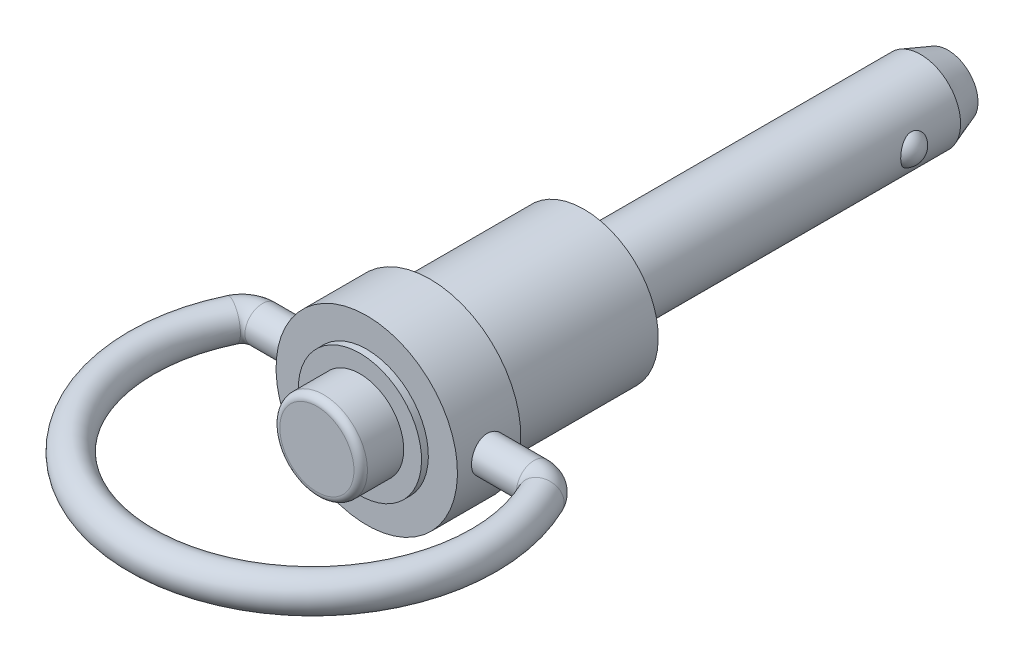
ISO-10303-21;
HEADER;
FILE_DESCRIPTION(('STEP AP214'),'2;1');
FILE_NAME('part.step','',(''),(''),'','','');
FILE_SCHEMA(('AUTOMOTIVE_DESIGN { 1 0 10303 214 1 1 1 1 }'));
ENDSEC;
DATA;
#1=APPLICATION_CONTEXT('core data for automotive mechanical design processes');
#2=APPLICATION_PROTOCOL_DEFINITION('international standard','automotive_design',2000,#1);
#3=PRODUCT_CONTEXT('',#1,'mechanical');
#4=PRODUCT('Part','Part','',(#3));
#5=PRODUCT_RELATED_PRODUCT_CATEGORY('part','',(#4));
#6=PRODUCT_DEFINITION_FORMATION('','',#4);
#7=PRODUCT_DEFINITION_CONTEXT('part definition',#1,'design');
#8=PRODUCT_DEFINITION('design','',#6,#7);
#9=PRODUCT_DEFINITION_SHAPE('','',#8);
#10=(LENGTH_UNIT() NAMED_UNIT(*) SI_UNIT(.MILLI.,.METRE.));
#11=(NAMED_UNIT(*) PLANE_ANGLE_UNIT() SI_UNIT($,.RADIAN.));
#12=(NAMED_UNIT(*) SI_UNIT($,.STERADIAN.) SOLID_ANGLE_UNIT());
#13=UNCERTAINTY_MEASURE_WITH_UNIT(LENGTH_MEASURE(1.E-05),#10,'distance_accuracy_value','');
#14=(GEOMETRIC_REPRESENTATION_CONTEXT(3) GLOBAL_UNCERTAINTY_ASSIGNED_CONTEXT((#13)) GLOBAL_UNIT_ASSIGNED_CONTEXT((#10,
#11,#12)) REPRESENTATION_CONTEXT('',''));
#15=CARTESIAN_POINT('',(0.,0.,0.));
#16=DIRECTION('',(0.,0.,1.));
#17=DIRECTION('',(1.,0.,0.));
#18=AXIS2_PLACEMENT_3D('',#15,#16,#17);
#19=CARTESIAN_POINT('',(0.,0.,20.828));
#20=DIRECTION('',(0.,0.,-1.));
#21=DIRECTION('',(0.,1.,0.));
#22=AXIS2_PLACEMENT_3D('',#19,#20,#21);
#23=CYLINDRICAL_SURFACE('',#22,3.2512);
#24=CARTESIAN_POINT('',(0.,0.,16.637));
#25=DIRECTION('',(0.,0.,-1.));
#26=DIRECTION('',(0.,1.,0.));
#27=AXIS2_PLACEMENT_3D('',#24,#25,#26);
#28=CIRCLE('',#27,3.2512);
#29=CARTESIAN_POINT('',(0.,3.2512,16.637));
#30=VERTEX_POINT('',#29);
#31=EDGE_CURVE('E30',#30,#30,#28,.T.);
#32=ORIENTED_EDGE('',*,*,#31,.F.);
#33=EDGE_LOOP('',(#32));
#34=FACE_BOUND('',#33,.T.);
#35=CARTESIAN_POINT('',(0.,0.,19.328));
#36=DIRECTION('',(0.,0.,1.));
#37=DIRECTION('',(1.,0.,0.));
#38=AXIS2_PLACEMENT_3D('',#35,#36,#37);
#39=CIRCLE('',#38,3.2512);
#40=CARTESIAN_POINT('',(3.2512,0.,19.328));
#41=VERTEX_POINT('',#40);
#42=EDGE_CURVE('E156',#41,#41,#39,.T.);
#43=ORIENTED_EDGE('',*,*,#42,.F.);
#44=EDGE_LOOP('',(#43));
#45=FACE_BOUND('',#44,.T.);
#46=ADVANCED_FACE('F12',(#34,#45),#23,.T.);
#47=CARTESIAN_POINT('',(4.572,0.,16.637));
#48=DIRECTION('',(0.,0.,1.));
#49=DIRECTION('',(0.,-1.,0.));
#50=AXIS2_PLACEMENT_3D('',#47,#48,#49);
#51=PLANE('',#50);
#52=ORIENTED_EDGE('',*,*,#31,.T.);
#53=EDGE_LOOP('',(#52));
#54=FACE_BOUND('',#53,.T.);
#55=CARTESIAN_POINT('',(0.,0.,16.637));
#56=DIRECTION('',(0.,0.,-1.));
#57=DIRECTION('',(0.,1.,0.));
#58=AXIS2_PLACEMENT_3D('',#55,#56,#57);
#59=CIRCLE('',#58,4.572);
#60=CARTESIAN_POINT('',(0.,4.572,16.637));
#61=VERTEX_POINT('',#60);
#62=EDGE_CURVE('E35',#61,#61,#59,.T.);
#63=ORIENTED_EDGE('',*,*,#62,.F.);
#64=EDGE_LOOP('',(#63));
#65=FACE_BOUND('',#64,.T.);
#66=ADVANCED_FACE('F76',(#54,#65),#51,.T.);
#67=CARTESIAN_POINT('',(0.,0.,0.));
#68=DIRECTION('',(0.,0.,-1.));
#69=DIRECTION('',(0.,1.,0.));
#70=AXIS2_PLACEMENT_3D('',#67,#68,#69);
#71=CYLINDRICAL_SURFACE('',#70,4.572);
#72=ORIENTED_EDGE('',*,*,#62,.T.);
#73=EDGE_LOOP('',(#72));
#74=FACE_BOUND('',#73,.T.);
#75=CARTESIAN_POINT('',(0.,0.,16.129));
#76=DIRECTION('',(0.,0.,-1.));
#77=DIRECTION('',(0.,1.,0.));
#78=AXIS2_PLACEMENT_3D('',#75,#76,#77);
#79=CIRCLE('',#78,4.572);
#80=CARTESIAN_POINT('',(0.,4.572,16.129));
#81=VERTEX_POINT('',#80);
#82=EDGE_CURVE('E38',#81,#81,#79,.T.);
#83=ORIENTED_EDGE('',*,*,#82,.F.);
#84=EDGE_LOOP('',(#83));
#85=FACE_BOUND('',#84,.T.);
#86=ADVANCED_FACE('F146',(#74,#85),#71,.T.);
#87=CARTESIAN_POINT('',(6.731,0.,16.129));
#88=DIRECTION('',(0.,0.,1.));
#89=DIRECTION('',(0.,-1.,0.));
#90=AXIS2_PLACEMENT_3D('',#87,#88,#89);
#91=PLANE('',#90);
#92=CARTESIAN_POINT('',(0.,0.,16.129));
#93=DIRECTION('',(0.,0.,-1.));
#94=DIRECTION('',(0.,1.,0.));
#95=AXIS2_PLACEMENT_3D('',#92,#93,#94);
#96=CIRCLE('',#95,6.731);
#97=CARTESIAN_POINT('',(0.,6.731,16.129));
#98=VERTEX_POINT('',#97);
#99=EDGE_CURVE('E41',#98,#98,#96,.T.);
#100=ORIENTED_EDGE('',*,*,#99,.F.);
#101=EDGE_LOOP('',(#100));
#102=FACE_BOUND('',#101,.T.);
#103=ORIENTED_EDGE('',*,*,#82,.T.);
#104=EDGE_LOOP('',(#103));
#105=FACE_BOUND('',#104,.T.);
#106=ADVANCED_FACE('F191',(#102,#105),#91,.T.);
#107=CARTESIAN_POINT('',(0.,0.,0.));
#108=DIRECTION('',(0.,0.,-1.));
#109=DIRECTION('',(0.,1.,0.));
#110=AXIS2_PLACEMENT_3D('',#107,#108,#109);
#111=CYLINDRICAL_SURFACE('',#110,6.731);
#112=ORIENTED_EDGE('',*,*,#99,.T.);
#113=EDGE_LOOP('',(#112));
#114=FACE_BOUND('',#113,.T.);
#115=CARTESIAN_POINT('',(0.,0.,11.43));
#116=DIRECTION('',(0.,0.,-1.));
#117=DIRECTION('',(0.,1.,0.));
#118=AXIS2_PLACEMENT_3D('',#115,#116,#117);
#119=CIRCLE('',#118,6.731);
#120=CARTESIAN_POINT('',(0.,6.731,11.43));
#121=VERTEX_POINT('',#120);
#122=EDGE_CURVE('E27',#121,#121,#119,.T.);
#123=ORIENTED_EDGE('',*,*,#122,.F.);
#124=EDGE_LOOP('',(#123));
#125=FACE_BOUND('',#124,.T.);
#126=CARTESIAN_POINT('',(-6.6051722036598,1.2954,13.7922));
#127=CARTESIAN_POINT('',(-6.60517361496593,1.2953972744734,13.720163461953));
#128=CARTESIAN_POINT('',(-6.60636346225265,1.28937073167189,13.6480919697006));
#129=CARTESIAN_POINT('',(-6.61098794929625,1.26544153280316,13.5059837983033));
#130=CARTESIAN_POINT('',(-6.61442445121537,1.2475290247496,13.4359488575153));
#131=CARTESIAN_POINT('',(-6.62313895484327,1.20040052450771,13.2999904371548));
#132=CARTESIAN_POINT('',(-6.62841519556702,1.17119533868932,13.2340630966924));
#133=CARTESIAN_POINT('',(-6.64021258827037,1.10233951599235,13.1080471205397));
#134=CARTESIAN_POINT('',(-6.64673365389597,1.06268960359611,13.0479580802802));
#135=CARTESIAN_POINT('',(-6.66038139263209,0.973516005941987,12.9345330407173));
#136=CARTESIAN_POINT('',(-6.66751428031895,0.9238817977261,12.8812846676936));
#137=CARTESIAN_POINT('',(-6.68152715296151,0.816387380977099,12.7838165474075));
#138=CARTESIAN_POINT('',(-6.6884071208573,0.758526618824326,12.7395974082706));
#139=CARTESIAN_POINT('',(-6.7012057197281,0.635644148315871,12.6611055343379));
#140=CARTESIAN_POINT('',(-6.70711617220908,0.57056857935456,12.6269156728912));
#141=CARTESIAN_POINT('',(-6.71724013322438,0.435464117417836,12.569987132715));
#142=CARTESIAN_POINT('',(-6.72145378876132,0.365435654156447,12.5472474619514));
#143=CARTESIAN_POINT('',(-6.72766549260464,0.223321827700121,12.5141364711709));
#144=CARTESIAN_POINT('',(-6.72968999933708,0.151272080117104,12.5036173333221));
#145=CARTESIAN_POINT('',(-6.73138656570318,0.00640388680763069,12.494785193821));
#146=CARTESIAN_POINT('',(-6.73105883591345,-0.0664144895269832,12.4964710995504));
#147=CARTESIAN_POINT('',(-6.72810846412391,-0.209738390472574,12.511888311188));
#148=CARTESIAN_POINT('',(-6.72551615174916,-0.280261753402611,12.5254604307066));
#149=CARTESIAN_POINT('',(-6.71836197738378,-0.418011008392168,12.5640127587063));
#150=CARTESIAN_POINT('',(-6.71380004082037,-0.485236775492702,12.5889933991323));
#151=CARTESIAN_POINT('',(-6.70316878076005,-0.614941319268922,12.6498036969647));
#152=CARTESIAN_POINT('',(-6.69709072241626,-0.677389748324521,12.6856964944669));
#153=CARTESIAN_POINT('',(-6.68409856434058,-0.795436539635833,12.7672656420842));
#154=CARTESIAN_POINT('',(-6.677184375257,-0.851034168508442,12.8129430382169));
#155=CARTESIAN_POINT('',(-6.66315320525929,-0.954744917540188,12.9136604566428));
#156=CARTESIAN_POINT('',(-6.65603475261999,-1.00272266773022,12.9688397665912));
#157=CARTESIAN_POINT('',(-6.64250376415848,-1.08876420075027,13.0865320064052));
#158=CARTESIAN_POINT('',(-6.63609123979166,-1.12682782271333,13.1490450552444));
#159=CARTESIAN_POINT('',(-6.62469571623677,-1.19200234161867,13.2798155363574));
#160=CARTESIAN_POINT('',(-6.61971540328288,-1.21909269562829,13.3480834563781));
#161=CARTESIAN_POINT('',(-6.61178862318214,-1.26138008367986,13.4883195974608));
#162=CARTESIAN_POINT('',(-6.60884191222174,-1.27657854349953,13.5602873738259));
#163=CARTESIAN_POINT('',(-6.60536444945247,-1.29445125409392,13.7046572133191));
#164=CARTESIAN_POINT('',(-6.60479610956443,-1.29732037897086,13.7770342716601));
#165=CARTESIAN_POINT('',(-6.60603903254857,-1.29097613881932,13.9212330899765));
#166=CARTESIAN_POINT('',(-6.60785017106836,-1.28176340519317,13.9930548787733));
#167=CARTESIAN_POINT('',(-6.6136128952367,-1.25168453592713,14.1334581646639));
#168=CARTESIAN_POINT('',(-6.61754556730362,-1.23092132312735,14.2020625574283));
#169=CARTESIAN_POINT('',(-6.62709183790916,-1.17844042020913,14.334818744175));
#170=CARTESIAN_POINT('',(-6.63270556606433,-1.14672188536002,14.3989701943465));
#171=CARTESIAN_POINT('',(-6.6450665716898,-1.07278507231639,14.5218557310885));
#172=CARTESIAN_POINT('',(-6.65182676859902,-1.03044414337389,14.5805146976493));
#173=CARTESIAN_POINT('',(-6.66568301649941,-0.936629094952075,14.6899658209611));
#174=CARTESIAN_POINT('',(-6.67277909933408,-0.885154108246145,14.7407572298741));
#175=CARTESIAN_POINT('',(-6.6866288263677,-0.773660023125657,14.8337637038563));
#176=CARTESIAN_POINT('',(-6.69337621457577,-0.713530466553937,14.8758474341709));
#177=CARTESIAN_POINT('',(-6.70566168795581,-0.586941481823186,14.9493152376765));
#178=CARTESIAN_POINT('',(-6.71119982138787,-0.520482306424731,14.9806997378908));
#179=CARTESIAN_POINT('',(-6.72041595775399,-0.383476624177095,15.0316835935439));
#180=CARTESIAN_POINT('',(-6.72410395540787,-0.312954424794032,15.0513463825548));
#181=CARTESIAN_POINT('',(-6.72924701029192,-0.169530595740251,15.0785305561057));
#182=CARTESIAN_POINT('',(-6.7307023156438,-0.0966292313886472,15.0860532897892));
#183=CARTESIAN_POINT('',(-6.73121071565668,0.0482259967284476,15.0886947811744));
#184=CARTESIAN_POINT('',(-6.73030215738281,0.120176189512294,15.0840115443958));
#185=CARTESIAN_POINT('',(-6.72626496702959,0.26224403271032,15.0628090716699));
#186=CARTESIAN_POINT('',(-6.72313635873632,0.332361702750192,15.0462899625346));
#187=CARTESIAN_POINT('',(-6.71501101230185,0.468662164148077,15.0019698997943));
#188=CARTESIAN_POINT('',(-6.710017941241,0.534852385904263,14.9741910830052));
#189=CARTESIAN_POINT('',(-6.69870305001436,0.661661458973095,14.9081643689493));
#190=CARTESIAN_POINT('',(-6.69238113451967,0.722279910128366,14.8699157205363));
#191=CARTESIAN_POINT('',(-6.6789853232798,0.837208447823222,14.7833588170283));
#192=CARTESIAN_POINT('',(-6.67190155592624,0.891410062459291,14.7349080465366));
#193=CARTESIAN_POINT('',(-6.65784127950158,0.990982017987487,14.62961686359));
#194=CARTESIAN_POINT('',(-6.65086479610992,1.03635027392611,14.5727744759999));
#195=CARTESIAN_POINT('',(-6.63773378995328,1.11738877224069,14.4516440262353));
#196=CARTESIAN_POINT('',(-6.63158802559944,1.15295925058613,14.3872882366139));
#197=CARTESIAN_POINT('',(-6.62092027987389,1.21272619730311,14.2534152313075));
#198=CARTESIAN_POINT('',(-6.61639678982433,1.23693323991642,14.1839028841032));
#199=CARTESIAN_POINT('',(-6.61041337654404,1.26845390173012,14.0605363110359));
#200=CARTESIAN_POINT('',(-6.60845980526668,1.27854107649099,14.00739730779));
#201=CARTESIAN_POINT('',(-6.60583870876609,1.29201504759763,13.9002454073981));
#202=CARTESIAN_POINT('',(-6.60517114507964,1.29540204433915,13.8462325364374));
#203=CARTESIAN_POINT('',(-6.6051722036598,1.2954,13.7922));
#204=B_SPLINE_CURVE_WITH_KNOTS('',3,(#126,#127,#128,#129,#130,#131,#132,#133,#134,#135,#136,
#137,#138,#139,#140,#141,#142,#143,#144,#145,#146,#147,#148,#149,#150,#151,#152,#153,#154,#155,
#156,#157,#158,#159,#160,#161,#162,#163,#164,#165,#166,#167,#168,#169,#170,#171,#172,#173,#174,
#175,#176,#177,#178,#179,#180,#181,#182,#183,#184,#185,#186,#187,#188,#189,#190,#191,#192,#193,
#194,#195,#196,#197,#198,#199,#200,#201,#202,#203),.UNSPECIFIED.,.T.,.F.,(4,2,2,2,2,2,2,2,2,2,2,
2,2,2,2,2,2,2,2,2,2,2,2,2,2,2,2,2,2,2,2,2,2,2,2,2,2,2,4),(0.,0.215911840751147,
0.432002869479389,0.647887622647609,0.86375740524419,1.08216318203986,1.30058366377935,
1.52076118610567,1.74091962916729,1.95838638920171,2.1758336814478,2.39041258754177,
2.60499961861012,2.82085272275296,3.0367289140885,3.25609136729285,3.47545737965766,
3.69523218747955,3.91498064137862,4.13124273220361,4.34749352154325,4.56184753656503,
4.77621808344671,4.99318797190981,5.21017847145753,5.43023526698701,5.65028327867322,
5.86912939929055,6.08795119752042,6.30324544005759,6.51853737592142,6.73340808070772,
6.94829420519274,7.16640910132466,7.38457541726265,7.60488731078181,7.82499378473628,
7.98694789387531,8.14889715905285),.UNSPECIFIED.);
#205=CARTESIAN_POINT('',(-6.6051722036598,1.2954,13.7922));
#206=VERTEX_POINT('',#205);
#207=EDGE_CURVE('E88',#206,#206,#204,.T.);
#208=ORIENTED_EDGE('',*,*,#207,.F.);
#209=EDGE_LOOP('',(#208));
#210=FACE_BOUND('',#209,.T.);
#211=CARTESIAN_POINT('',(6.6051722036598,1.2954,13.7922));
#212=CARTESIAN_POINT('',(6.60517361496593,1.2953972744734,13.864236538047));
#213=CARTESIAN_POINT('',(6.60636346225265,1.2893707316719,13.9363080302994));
#214=CARTESIAN_POINT('',(6.61098794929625,1.26544153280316,14.0784162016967));
#215=CARTESIAN_POINT('',(6.61442445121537,1.24752902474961,14.1484511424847));
#216=CARTESIAN_POINT('',(6.62313895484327,1.20040052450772,14.2844095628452));
#217=CARTESIAN_POINT('',(6.62841519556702,1.17119533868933,14.3503369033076));
#218=CARTESIAN_POINT('',(6.64021258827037,1.10233951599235,14.4763528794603));
#219=CARTESIAN_POINT('',(6.64673365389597,1.06268960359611,14.5364419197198));
#220=CARTESIAN_POINT('',(6.66038139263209,0.973516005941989,14.6498669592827));
#221=CARTESIAN_POINT('',(6.66751428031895,0.923881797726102,14.7031153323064));
#222=CARTESIAN_POINT('',(6.68152715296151,0.816387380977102,14.8005834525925));
#223=CARTESIAN_POINT('',(6.6884071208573,0.75852661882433,14.8448025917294));
#224=CARTESIAN_POINT('',(6.7012057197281,0.635644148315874,14.9232944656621));
#225=CARTESIAN_POINT('',(6.70711617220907,0.570568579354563,14.9574843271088));
#226=CARTESIAN_POINT('',(6.71724013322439,0.435464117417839,15.014412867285));
#227=CARTESIAN_POINT('',(6.72145378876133,0.36543565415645,15.0371525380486));
#228=CARTESIAN_POINT('',(6.72766549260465,0.223321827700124,15.0702635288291));
#229=CARTESIAN_POINT('',(6.72968999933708,0.151272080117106,15.0807826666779));
#230=CARTESIAN_POINT('',(6.73138656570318,0.00640388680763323,15.089614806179));
#231=CARTESIAN_POINT('',(6.73105883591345,-0.0664144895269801,15.0879289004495));
#232=CARTESIAN_POINT('',(6.72810846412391,-0.209738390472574,15.072511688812));
#233=CARTESIAN_POINT('',(6.72551615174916,-0.280261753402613,15.0589395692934));
#234=CARTESIAN_POINT('',(6.71836197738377,-0.418011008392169,15.0203872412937));
#235=CARTESIAN_POINT('',(6.71380004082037,-0.485236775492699,14.9954066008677));
#236=CARTESIAN_POINT('',(6.70316878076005,-0.614941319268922,14.9345963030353));
#237=CARTESIAN_POINT('',(6.69709072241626,-0.677389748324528,14.8987035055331));
#238=CARTESIAN_POINT('',(6.68409856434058,-0.79543653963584,14.8171343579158));
#239=CARTESIAN_POINT('',(6.677184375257,-0.851034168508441,14.7714569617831));
#240=CARTESIAN_POINT('',(6.66315320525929,-0.954744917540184,14.6707395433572));
#241=CARTESIAN_POINT('',(6.65603475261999,-1.00272266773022,14.6155602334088));
#242=CARTESIAN_POINT('',(6.64250376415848,-1.08876420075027,14.4978679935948));
#243=CARTESIAN_POINT('',(6.63609123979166,-1.12682782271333,14.4353549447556));
#244=CARTESIAN_POINT('',(6.62469571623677,-1.19200234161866,14.3045844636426));
#245=CARTESIAN_POINT('',(6.61971540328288,-1.21909269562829,14.2363165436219));
#246=CARTESIAN_POINT('',(6.61178862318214,-1.26138008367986,14.0960804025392));
#247=CARTESIAN_POINT('',(6.60884191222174,-1.27657854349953,14.0241126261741));
#248=CARTESIAN_POINT('',(6.60536444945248,-1.29445125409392,13.8797427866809));
#249=CARTESIAN_POINT('',(6.60479610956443,-1.29732037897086,13.8073657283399));
#250=CARTESIAN_POINT('',(6.60603903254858,-1.29097613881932,13.6631669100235));
#251=CARTESIAN_POINT('',(6.60785017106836,-1.28176340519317,13.5913451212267));
#252=CARTESIAN_POINT('',(6.6136128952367,-1.25168453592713,13.4509418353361));
#253=CARTESIAN_POINT('',(6.61754556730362,-1.23092132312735,13.3823374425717));
#254=CARTESIAN_POINT('',(6.62709183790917,-1.17844042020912,13.249581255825));
#255=CARTESIAN_POINT('',(6.63270556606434,-1.14672188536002,13.1854298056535));
#256=CARTESIAN_POINT('',(6.64506657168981,-1.07278507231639,13.0625442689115));
#257=CARTESIAN_POINT('',(6.65182676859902,-1.03044414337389,13.0038853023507));
#258=CARTESIAN_POINT('',(6.66568301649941,-0.936629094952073,12.8944341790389));
#259=CARTESIAN_POINT('',(6.67277909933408,-0.885154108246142,12.8436427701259));
#260=CARTESIAN_POINT('',(6.68662882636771,-0.773660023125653,12.7506362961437));
#261=CARTESIAN_POINT('',(6.69337621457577,-0.713530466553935,12.7085525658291));
#262=CARTESIAN_POINT('',(6.70566168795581,-0.586941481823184,12.6350847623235));
#263=CARTESIAN_POINT('',(6.71119982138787,-0.520482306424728,12.6037002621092));
#264=CARTESIAN_POINT('',(6.72041595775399,-0.383476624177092,12.5527164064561));
#265=CARTESIAN_POINT('',(6.72410395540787,-0.31295442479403,12.5330536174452));
#266=CARTESIAN_POINT('',(6.72924701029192,-0.169530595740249,12.5058694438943));
#267=CARTESIAN_POINT('',(6.7307023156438,-0.0966292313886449,12.4983467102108));
#268=CARTESIAN_POINT('',(6.73121071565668,0.0482259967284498,12.4957052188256));
#269=CARTESIAN_POINT('',(6.73030215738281,0.120176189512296,12.5003884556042));
#270=CARTESIAN_POINT('',(6.72626496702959,0.262244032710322,12.5215909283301));
#271=CARTESIAN_POINT('',(6.72313635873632,0.332361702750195,12.5381100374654));
#272=CARTESIAN_POINT('',(6.71501101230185,0.46866216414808,12.5824301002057));
#273=CARTESIAN_POINT('',(6.710017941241,0.534852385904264,12.6102089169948));
#274=CARTESIAN_POINT('',(6.69870305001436,0.661661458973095,12.6762356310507));
#275=CARTESIAN_POINT('',(6.69238113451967,0.722279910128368,12.7144842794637));
#276=CARTESIAN_POINT('',(6.6789853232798,0.837208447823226,12.8010411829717));
#277=CARTESIAN_POINT('',(6.67190155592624,0.891410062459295,12.8494919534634));
#278=CARTESIAN_POINT('',(6.65784127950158,0.99098201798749,12.95478313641));
#279=CARTESIAN_POINT('',(6.65086479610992,1.03635027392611,13.0116255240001));
#280=CARTESIAN_POINT('',(6.63773378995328,1.1173887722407,13.1327559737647));
#281=CARTESIAN_POINT('',(6.63158802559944,1.15295925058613,13.1971117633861));
#282=CARTESIAN_POINT('',(6.62092027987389,1.21272619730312,13.3309847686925));
#283=CARTESIAN_POINT('',(6.61639678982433,1.23693323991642,13.4004971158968));
#284=CARTESIAN_POINT('',(6.61041337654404,1.26845390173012,13.5238636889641));
#285=CARTESIAN_POINT('',(6.60845980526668,1.27854107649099,13.57700269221));
#286=CARTESIAN_POINT('',(6.60583870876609,1.29201504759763,13.6841545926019));
#287=CARTESIAN_POINT('',(6.60517114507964,1.29540204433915,13.7381674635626));
#288=CARTESIAN_POINT('',(6.6051722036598,1.2954,13.7922));
#289=B_SPLINE_CURVE_WITH_KNOTS('',3,(#211,#212,#213,#214,#215,#216,#217,#218,#219,#220,#221,
#222,#223,#224,#225,#226,#227,#228,#229,#230,#231,#232,#233,#234,#235,#236,#237,#238,#239,#240,
#241,#242,#243,#244,#245,#246,#247,#248,#249,#250,#251,#252,#253,#254,#255,#256,#257,#258,#259,
#260,#261,#262,#263,#264,#265,#266,#267,#268,#269,#270,#271,#272,#273,#274,#275,#276,#277,#278,
#279,#280,#281,#282,#283,#284,#285,#286,#287,#288),.UNSPECIFIED.,.T.,.F.,(4,2,2,2,2,2,2,2,2,2,2,
2,2,2,2,2,2,2,2,2,2,2,2,2,2,2,2,2,2,2,2,2,2,2,2,2,2,2,4),(0.,0.215911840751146,
0.432002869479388,0.647887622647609,0.86375740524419,1.08216318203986,1.30058366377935,
1.52076118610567,1.74091962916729,1.95838638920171,2.1758336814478,2.39041258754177,
2.60499961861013,2.82085272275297,3.0367289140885,3.25609136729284,3.47545737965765,
3.69523218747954,3.91498064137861,4.13124273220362,4.34749352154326,4.56184753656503,
4.7762180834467,4.99318797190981,5.21017847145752,5.430235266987,5.65028327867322,
5.86912939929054,6.08795119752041,6.30324544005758,6.51853737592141,6.73340808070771,
6.94829420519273,7.16640910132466,7.38457541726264,7.60488731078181,7.82499378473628,
7.9869478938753,8.14889715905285),.UNSPECIFIED.);
#290=CARTESIAN_POINT('',(6.6051722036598,1.2954,13.7922));
#291=VERTEX_POINT('',#290);
#292=EDGE_CURVE('E79',#291,#291,#289,.T.);
#293=ORIENTED_EDGE('',*,*,#292,.F.);
#294=EDGE_LOOP('',(#293));
#295=FACE_BOUND('',#294,.T.);
#296=ADVANCED_FACE('F142',(#114,#125,#210,#295),#111,.T.);
#297=CARTESIAN_POINT('',(5.7785,0.,11.43));
#298=DIRECTION('',(0.,0.,-1.));
#299=DIRECTION('',(0.,1.,0.));
#300=AXIS2_PLACEMENT_3D('',#297,#298,#299);
#301=PLANE('',#300);
#302=CARTESIAN_POINT('',(0.,0.,11.43));
#303=DIRECTION('',(0.,0.,-1.));
#304=DIRECTION('',(0.,1.,0.));
#305=AXIS2_PLACEMENT_3D('',#302,#303,#304);
#306=CIRCLE('',#305,5.9);
#307=CARTESIAN_POINT('',(0.,5.9,11.43));
#308=VERTEX_POINT('',#307);
#309=EDGE_CURVE('E19',#308,#308,#306,.F.);
#310=ORIENTED_EDGE('',*,*,#309,.T.);
#311=EDGE_LOOP('',(#310));
#312=FACE_BOUND('',#311,.T.);
#313=ORIENTED_EDGE('',*,*,#122,.T.);
#314=EDGE_LOOP('',(#313));
#315=FACE_BOUND('',#314,.T.);
#316=ADVANCED_FACE('F136',(#312,#315),#301,.T.);
#317=CARTESIAN_POINT('',(10.0803124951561,0.,15.3162));
#318=DIRECTION('',(0.,1.,0.));
#319=DIRECTION('',(-1.,0.,0.));
#320=AXIS2_PLACEMENT_3D('',#317,#318,#319);
#321=TOROIDAL_SURFACE('',#320,1.524,1.2954);
#322=CARTESIAN_POINT('',(11.4549005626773,0.,14.658109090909));
#323=DIRECTION('',(-0.431818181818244,0.,-0.901960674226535));
#324=DIRECTION('',(0.901960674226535,0.,-0.431818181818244));
#325=AXIS2_PLACEMENT_3D('',#322,#323,#324);
#326=CIRCLE('',#325,1.2954);
#327=CARTESIAN_POINT('',(12.6233004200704,0.,14.0987318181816));
#328=VERTEX_POINT('',#327);
#329=EDGE_CURVE('E46',#328,#328,#326,.T.);
#330=ORIENTED_EDGE('',*,*,#329,.T.);
#331=EDGE_LOOP('',(#330));
#332=FACE_BOUND('',#331,.T.);
#333=CARTESIAN_POINT('',(10.0803124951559,0.,13.7922));
#334=DIRECTION('',(1.,0.,0.));
#335=DIRECTION('',(0.,1.,0.));
#336=AXIS2_PLACEMENT_3D('',#333,#334,#335);
#337=CIRCLE('',#336,1.2954);
#338=CARTESIAN_POINT('',(10.0803124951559,1.2954,13.7922));
#339=VERTEX_POINT('',#338);
#340=EDGE_CURVE('E34',#339,#339,#337,.F.);
#341=ORIENTED_EDGE('',*,*,#340,.F.);
#342=EDGE_LOOP('',(#341));
#343=FACE_BOUND('',#342,.T.);
#344=ADVANCED_FACE('F74',(#332,#343),#321,.T.);
#345=CARTESIAN_POINT('',(-10.0803124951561,0.,13.7922));
#346=DIRECTION('',(1.,0.,0.));
#347=DIRECTION('',(0.,1.,0.));
#348=AXIS2_PLACEMENT_3D('',#345,#346,#347);
#349=CYLINDRICAL_SURFACE('',#348,1.2954);
#350=ORIENTED_EDGE('',*,*,#340,.T.);
#351=EDGE_LOOP('',(#350));
#352=FACE_BOUND('',#351,.T.);
#353=ORIENTED_EDGE('',*,*,#292,.T.);
#354=EDGE_LOOP('',(#353));
#355=FACE_BOUND('',#354,.T.);
#356=ADVANCED_FACE('F70',(#352,#355),#349,.T.);
#357=CARTESIAN_POINT('',(0.,0.,20.1422));
#358=DIRECTION('',(0.,1.,0.));
#359=DIRECTION('',(-1.,0.,0.));
#360=AXIS2_PLACEMENT_3D('',#357,#358,#359);
#361=TOROIDAL_SURFACE('',#360,12.7,1.2954);
#362=CARTESIAN_POINT('',(-11.4549005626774,0.,14.6581090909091));
#363=DIRECTION('',(-0.43181818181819,0.,0.901960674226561));
#364=DIRECTION('',(-0.901960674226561,0.,-0.43181818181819));
#365=AXIS2_PLACEMENT_3D('',#362,#363,#364);
#366=CIRCLE('',#365,1.2954);
#367=CARTESIAN_POINT('',(-12.6233004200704,0.,14.0987318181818));
#368=VERTEX_POINT('',#367);
#369=EDGE_CURVE('E49',#368,#368,#366,.F.);
#370=ORIENTED_EDGE('',*,*,#369,.F.);
#371=EDGE_LOOP('',(#370));
#372=FACE_BOUND('',#371,.T.);
#373=ORIENTED_EDGE('',*,*,#329,.F.);
#374=EDGE_LOOP('',(#373));
#375=FACE_BOUND('',#374,.T.);
#376=ADVANCED_FACE('F67',(#372,#375),#361,.T.);
#377=CARTESIAN_POINT('',(-10.0803124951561,0.,15.3162));
#378=DIRECTION('',(0.,1.,0.));
#379=DIRECTION('',(-1.,0.,0.));
#380=AXIS2_PLACEMENT_3D('',#377,#378,#379);
#381=TOROIDAL_SURFACE('',#380,1.524,1.2954);
#382=CARTESIAN_POINT('',(-10.0803124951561,0.,13.7922));
#383=DIRECTION('',(1.,0.,0.));
#384=DIRECTION('',(0.,1.,0.));
#385=AXIS2_PLACEMENT_3D('',#382,#383,#384);
#386=CIRCLE('',#385,1.2954);
#387=CARTESIAN_POINT('',(-10.0803124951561,1.2954,13.7922));
#388=VERTEX_POINT('',#387);
#389=EDGE_CURVE('E33',#388,#388,#386,.T.);
#390=ORIENTED_EDGE('',*,*,#389,.F.);
#391=EDGE_LOOP('',(#390));
#392=FACE_BOUND('',#391,.T.);
#393=ORIENTED_EDGE('',*,*,#369,.T.);
#394=EDGE_LOOP('',(#393));
#395=FACE_BOUND('',#394,.T.);
#396=ADVANCED_FACE('F62',(#392,#395),#381,.T.);
#397=CARTESIAN_POINT('',(-10.0803124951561,0.,13.7922));
#398=DIRECTION('',(1.,0.,0.));
#399=DIRECTION('',(0.,1.,0.));
#400=AXIS2_PLACEMENT_3D('',#397,#398,#399);
#401=CYLINDRICAL_SURFACE('',#400,1.2954);
#402=ORIENTED_EDGE('',*,*,#389,.T.);
#403=EDGE_LOOP('',(#402));
#404=FACE_BOUND('',#403,.T.);
#405=ORIENTED_EDGE('',*,*,#207,.T.);
#406=EDGE_LOOP('',(#405));
#407=FACE_BOUND('',#406,.T.);
#408=ADVANCED_FACE('F66',(#404,#407),#401,.T.);
#409=CARTESIAN_POINT('',(0.,0.,19.828));
#410=DIRECTION('',(0.,0.,1.));
#411=DIRECTION('',(1.,0.,0.));
#412=AXIS2_PLACEMENT_3D('',#409,#410,#411);
#413=PLANE('',#412);
#414=CARTESIAN_POINT('',(0.,0.,19.828));
#415=DIRECTION('',(0.,0.,1.));
#416=DIRECTION('',(1.,0.,0.));
#417=AXIS2_PLACEMENT_3D('',#414,#415,#416);
#418=CIRCLE('',#417,2.7512);
#419=CARTESIAN_POINT('',(2.7512,0.,19.828));
#420=VERTEX_POINT('',#419);
#421=EDGE_CURVE('E158',#420,#420,#418,.T.);
#422=ORIENTED_EDGE('',*,*,#421,.T.);
#423=EDGE_LOOP('',(#422));
#424=FACE_BOUND('',#423,.T.);
#425=ADVANCED_FACE('F98',(#424),#413,.T.);
#426=CARTESIAN_POINT('',(0.,0.,19.328));
#427=DIRECTION('',(0.,0.,1.));
#428=DIRECTION('',(1.,0.,0.));
#429=AXIS2_PLACEMENT_3D('',#426,#427,#428);
#430=TOROIDAL_SURFACE('',#429,2.7512,0.5);
#431=ORIENTED_EDGE('',*,*,#42,.T.);
#432=EDGE_LOOP('',(#431));
#433=FACE_BOUND('',#432,.T.);
#434=ORIENTED_EDGE('',*,*,#421,.F.);
#435=EDGE_LOOP('',(#434));
#436=FACE_BOUND('',#435,.T.);
#437=ADVANCED_FACE('F169',(#433,#436),#430,.T.);
#438=CARTESIAN_POINT('',(0.,0.,44.4537819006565));
#439=DIRECTION('',(0.,0.,-1.));
#440=DIRECTION('',(0.,1.,0.));
#441=AXIS2_PLACEMENT_3D('',#438,#439,#440);
#442=CYLINDRICAL_SURFACE('',#441,5.5);
#443=CARTESIAN_POINT('',(0.,0.,11.03));
#444=DIRECTION('',(0.,0.,-1.));
#445=DIRECTION('',(0.,1.,0.));
#446=AXIS2_PLACEMENT_3D('',#443,#444,#445);
#447=CIRCLE('',#446,5.5);
#448=CARTESIAN_POINT('',(0.,5.5,11.03));
#449=VERTEX_POINT('',#448);
#450=EDGE_CURVE('E8',#449,#449,#447,.T.);
#451=ORIENTED_EDGE('',*,*,#450,.T.);
#452=EDGE_LOOP('',(#451));
#453=FACE_BOUND('',#452,.T.);
#454=CARTESIAN_POINT('',(0.,0.,0.));
#455=DIRECTION('',(0.,0.,-1.));
#456=DIRECTION('',(0.,1.,0.));
#457=AXIS2_PLACEMENT_3D('',#454,#455,#456);
#458=CIRCLE('',#457,5.5);
#459=CARTESIAN_POINT('',(0.,5.5,0.));
#460=VERTEX_POINT('',#459);
#461=EDGE_CURVE('E159',#460,#460,#458,.T.);
#462=ORIENTED_EDGE('',*,*,#461,.F.);
#463=EDGE_LOOP('',(#462));
#464=FACE_BOUND('',#463,.T.);
#465=ADVANCED_FACE('F105',(#453,#464),#442,.T.);
#466=CARTESIAN_POINT('',(2.23030748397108,0.,-26.9964));
#467=DIRECTION('',(0.,0.,1.));
#468=DIRECTION('',(0.,-1.,0.));
#469=AXIS2_PLACEMENT_3D('',#466,#467,#468);
#470=PLANE('',#469);
#471=CARTESIAN_POINT('',(0.,0.,-26.9963999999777));
#472=DIRECTION('',(0.,0.,1.));
#473=DIRECTION('',(0.,-1.,0.));
#474=AXIS2_PLACEMENT_3D('',#471,#472,#473);
#475=CIRCLE('',#474,2.23030748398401);
#476=CARTESIAN_POINT('',(0.,-2.23030748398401,-26.9963999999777));
#477=VERTEX_POINT('',#476);
#478=EDGE_CURVE('E87',#477,#477,#475,.T.);
#479=ORIENTED_EDGE('',*,*,#478,.F.);
#480=EDGE_LOOP('',(#479));
#481=FACE_BOUND('',#480,.T.);
#482=ADVANCED_FACE('F100',(#481),#470,.F.);
#483=CARTESIAN_POINT('',(2.304415,0.,-21.51));
#484=DIRECTION('',(0.,0.,1.));
#485=DIRECTION('',(1.,0.,0.));
#486=AXIS2_PLACEMENT_3D('',#483,#484,#485);
#487=SPHERICAL_SURFACE('',#486,1.190625);
#488=CARTESIAN_POINT('',(2.969895,0.,-20.5227187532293));
#489=CARTESIAN_POINT('',(2.96989215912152,0.064879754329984,-20.5227204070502));
#490=CARTESIAN_POINT('',(2.9677488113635,0.129813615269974,-20.5276893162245));
#491=CARTESIAN_POINT('',(2.95937088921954,0.257945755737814,-20.547546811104));
#492=CARTESIAN_POINT('',(2.95313050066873,0.321141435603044,-20.5624494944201));
#493=CARTESIAN_POINT('',(2.93717671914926,0.443963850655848,-20.6020770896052));
#494=CARTESIAN_POINT('',(2.927461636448,0.503588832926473,-20.6268067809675));
#495=CARTESIAN_POINT('',(2.90558938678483,0.617402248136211,-20.6858521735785));
#496=CARTESIAN_POINT('',(2.89343280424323,0.671591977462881,-20.7201655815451));
#497=CARTESIAN_POINT('',(2.86839420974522,0.771479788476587,-20.79700516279));
#498=CARTESIAN_POINT('',(2.85553685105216,0.817351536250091,-20.8393126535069));
#499=CARTESIAN_POINT('',(2.83044802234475,0.900403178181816,-20.9319248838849));
#500=CARTESIAN_POINT('',(2.81821622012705,0.937587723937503,-20.9822253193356));
#501=CARTESIAN_POINT('',(2.79710280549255,0.998724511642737,-21.084854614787));
#502=CARTESIAN_POINT('',(2.78802161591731,1.02355036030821,-21.1366201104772));
#503=CARTESIAN_POINT('',(2.77310306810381,1.06331271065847,-21.2442484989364));
#504=CARTESIAN_POINT('',(2.76726231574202,1.07825956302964,-21.3001070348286));
#505=CARTESIAN_POINT('',(2.76014564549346,1.09633656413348,-21.4072555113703));
#506=CARTESIAN_POINT('',(2.75841717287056,1.10064055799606,-21.4583195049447));
#507=CARTESIAN_POINT('',(2.75839177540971,1.10070545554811,-21.5604466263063));
#508=CARTESIAN_POINT('',(2.76009369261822,1.09646924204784,-21.6115097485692));
#509=CARTESIAN_POINT('',(2.76652257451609,1.08013788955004,-21.7091717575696));
#510=CARTESIAN_POINT('',(2.77107366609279,1.0684990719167,-21.7558600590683));
#511=CARTESIAN_POINT('',(2.78254175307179,1.038266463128,-21.8466097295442));
#512=CARTESIAN_POINT('',(2.78945904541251,1.01967179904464,-21.8906707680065));
#513=CARTESIAN_POINT('',(2.80531085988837,0.975235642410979,-21.9770453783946));
#514=CARTESIAN_POINT('',(2.81431949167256,0.949116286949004,-22.0192017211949));
#515=CARTESIAN_POINT('',(2.83329926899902,0.890858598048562,-22.0988701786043));
#516=CARTESIAN_POINT('',(2.84327072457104,0.858718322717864,-22.1363807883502));
#517=CARTESIAN_POINT('',(2.86435381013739,0.785708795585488,-22.2098499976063));
#518=CARTESIAN_POINT('',(2.87547704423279,0.744281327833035,-22.2452503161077));
#519=CARTESIAN_POINT('',(2.89682125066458,0.656317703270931,-22.3093556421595));
#520=CARTESIAN_POINT('',(2.90704166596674,0.609778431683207,-22.3380565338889));
#521=CARTESIAN_POINT('',(2.92666236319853,0.507820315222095,-22.391048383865));
#522=CARTESIAN_POINT('',(2.93587462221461,0.451979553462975,-22.4145978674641));
#523=CARTESIAN_POINT('',(2.95127580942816,0.33704836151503,-22.4530177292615));
#524=CARTESIAN_POINT('',(2.95746769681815,0.277961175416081,-22.4678966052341));
#525=CARTESIAN_POINT('',(2.96452684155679,0.182100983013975,-22.4846891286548));
#526=CARTESIAN_POINT('',(2.96653354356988,0.145876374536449,-22.4894090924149));
#527=CARTESIAN_POINT('',(2.96921843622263,0.0731069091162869,-22.4957056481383));
#528=CARTESIAN_POINT('',(2.9698966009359,0.0365620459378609,-22.4972821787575));
#529=CARTESIAN_POINT('',(2.96989215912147,-0.0648797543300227,-22.4972795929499));
#530=CARTESIAN_POINT('',(2.96774881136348,-0.129813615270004,-22.4923106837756));
#531=CARTESIAN_POINT('',(2.95937088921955,-0.25794575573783,-22.472453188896));
#532=CARTESIAN_POINT('',(2.95313050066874,-0.321141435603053,-22.4575505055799));
#533=CARTESIAN_POINT('',(2.93717671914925,-0.443963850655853,-22.4179229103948));
#534=CARTESIAN_POINT('',(2.927461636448,-0.50358883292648,-22.3931932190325));
#535=CARTESIAN_POINT('',(2.90558938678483,-0.617402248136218,-22.3341478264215));
#536=CARTESIAN_POINT('',(2.89343280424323,-0.671591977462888,-22.2998344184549));
#537=CARTESIAN_POINT('',(2.86839420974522,-0.771479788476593,-22.22299483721));
#538=CARTESIAN_POINT('',(2.85553685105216,-0.817351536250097,-22.1806873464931));
#539=CARTESIAN_POINT('',(2.83044802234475,-0.900403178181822,-22.0880751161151));
#540=CARTESIAN_POINT('',(2.81821622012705,-0.937587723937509,-22.0377746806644));
#541=CARTESIAN_POINT('',(2.79710280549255,-0.998724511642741,-21.935145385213));
#542=CARTESIAN_POINT('',(2.78802161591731,-1.02355036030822,-21.8833798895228));
#543=CARTESIAN_POINT('',(2.77310306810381,-1.06331271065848,-21.7757515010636));
#544=CARTESIAN_POINT('',(2.76726231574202,-1.07825956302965,-21.7198929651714));
#545=CARTESIAN_POINT('',(2.76014564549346,-1.09633656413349,-21.6127444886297));
#546=CARTESIAN_POINT('',(2.75841717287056,-1.10064055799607,-21.5616804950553));
#547=CARTESIAN_POINT('',(2.75839177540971,-1.10070545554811,-21.4595533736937));
#548=CARTESIAN_POINT('',(2.76009369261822,-1.09646924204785,-21.4084902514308));
#549=CARTESIAN_POINT('',(2.76652257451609,-1.08013788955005,-21.3108282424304));
#550=CARTESIAN_POINT('',(2.77107366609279,-1.0684990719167,-21.2641399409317));
#551=CARTESIAN_POINT('',(2.78254175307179,-1.038266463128,-21.1733902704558));
#552=CARTESIAN_POINT('',(2.78945904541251,-1.01967179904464,-21.1293292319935));
#553=CARTESIAN_POINT('',(2.80531085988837,-0.975235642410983,-21.0429546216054));
#554=CARTESIAN_POINT('',(2.81431949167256,-0.949116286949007,-21.0007982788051));
#555=CARTESIAN_POINT('',(2.83329926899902,-0.890858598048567,-20.9211298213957));
#556=CARTESIAN_POINT('',(2.84327072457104,-0.85871832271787,-20.8836192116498));
#557=CARTESIAN_POINT('',(2.86435381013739,-0.785708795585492,-20.8101500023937));
#558=CARTESIAN_POINT('',(2.87547704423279,-0.744281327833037,-20.7747496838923));
#559=CARTESIAN_POINT('',(2.89682125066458,-0.656317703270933,-20.7106443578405));
#560=CARTESIAN_POINT('',(2.90704166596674,-0.609778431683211,-20.6819434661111));
#561=CARTESIAN_POINT('',(2.92666236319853,-0.5078203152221,-20.628951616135));
#562=CARTESIAN_POINT('',(2.93587462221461,-0.451979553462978,-20.6054021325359));
#563=CARTESIAN_POINT('',(2.95127580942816,-0.337048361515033,-20.5669822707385));
#564=CARTESIAN_POINT('',(2.95746769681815,-0.277961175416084,-20.5521033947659));
#565=CARTESIAN_POINT('',(2.96452684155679,-0.182100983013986,-20.5353108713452));
#566=CARTESIAN_POINT('',(2.96653354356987,-0.145876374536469,-20.5305909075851));
#567=CARTESIAN_POINT('',(2.96921843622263,-0.0731069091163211,-20.5242943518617));
#568=CARTESIAN_POINT('',(2.96989660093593,-0.0365620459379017,-20.5227178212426));
#569=CARTESIAN_POINT('',(2.969895,0.,-20.5227187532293));
#570=B_SPLINE_CURVE_WITH_KNOTS('',3,(#488,#489,#490,#491,#492,#493,#494,#495,#496,#497,#498,
#499,#500,#501,#502,#503,#504,#505,#506,#507,#508,#509,#510,#511,#512,#513,#514,#515,#516,#517,
#518,#519,#520,#521,#522,#523,#524,#525,#526,#527,#528,#529,#530,#531,#532,#533,#534,#535,#536,
#537,#538,#539,#540,#541,#542,#543,#544,#545,#546,#547,#548,#549,#550,#551,#552,#553,#554,#555,
#556,#557,#558,#559,#560,#561,#562,#563,#564,#565,#566,#567,#568,#569),.UNSPECIFIED.,.T.,.F.,(4,
2,2,2,2,2,2,2,2,2,2,2,2,2,2,2,2,2,2,2,2,2,2,2,2,2,2,2,2,2,2,2,2,2,2,2,2,2,2,2,4),(0.,
0.194508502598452,0.389293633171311,0.584173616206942,0.779007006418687,0.969128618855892,
1.15914819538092,1.33252765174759,1.50572516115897,1.65874388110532,1.81171095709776,
1.95605797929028,2.10042312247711,2.25101209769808,2.4016497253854,2.56781072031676,
2.73407352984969,2.91718248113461,3.10011167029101,3.20972198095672,3.31933443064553,
3.51384293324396,3.7086280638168,3.90350804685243,4.09834143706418,4.28846304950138,
4.47848262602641,4.65186208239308,4.82505959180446,4.97807831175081,5.13104538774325,
5.27539240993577,5.4197575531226,5.57034652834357,5.72098415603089,5.88714515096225,
6.05340796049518,6.2365169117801,6.4194461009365,6.52905641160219,6.63866886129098),.UNSPECIFIED.);
#571=CARTESIAN_POINT('',(2.969895,0.,-20.5227187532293));
#572=VERTEX_POINT('',#571);
#573=EDGE_CURVE('E115',#572,#572,#570,.T.);
#574=ORIENTED_EDGE('',*,*,#573,.F.);
#575=EDGE_LOOP('',(#574));
#576=FACE_BOUND('',#575,.T.);
#577=ADVANCED_FACE('F104',(#576),#487,.T.);
#578=CARTESIAN_POINT('',(-2.304335,0.,-21.51));
#579=DIRECTION('',(0.,0.,1.));
#580=DIRECTION('',(1.,0.,0.));
#581=AXIS2_PLACEMENT_3D('',#578,#579,#580);
#582=SPHERICAL_SURFACE('',#581,1.190625);
#583=CARTESIAN_POINT('',(-2.969895,0.,-20.5227726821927));
#584=CARTESIAN_POINT('',(-2.96989215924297,-0.0648782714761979,-20.5227743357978));
#585=CARTESIAN_POINT('',(-2.96774890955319,-0.129810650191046,-20.5277431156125));
#586=CARTESIAN_POINT('',(-2.95937136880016,-0.257939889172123,-20.5476001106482));
#587=CARTESIAN_POINT('',(-2.95313126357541,-0.321134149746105,-20.5625024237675));
#588=CARTESIAN_POINT('',(-2.9371782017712,-0.44395384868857,-20.602129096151));
#589=CARTESIAN_POINT('',(-2.92746355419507,-0.503577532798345,-20.6268582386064));
#590=CARTESIAN_POINT('',(-2.90559229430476,-0.617388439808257,-20.6859024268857));
#591=CARTESIAN_POINT('',(-2.89343626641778,-0.67157695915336,-20.720215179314));
#592=CARTESIAN_POINT('',(-2.86839896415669,-0.77146199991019,-20.7970531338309));
#593=CARTESIAN_POINT('',(-2.85554234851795,-0.817332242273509,-20.8393595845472));
#594=CARTESIAN_POINT('',(-2.83045508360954,-0.900380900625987,-20.9319696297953));
#595=CARTESIAN_POINT('',(-2.8182241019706,-0.937563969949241,-20.9822689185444));
#596=CARTESIAN_POINT('',(-2.79711253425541,-0.998697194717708,-21.0848948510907));
#597=CARTESIAN_POINT('',(-2.78803232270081,-1.02352115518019,-21.1366580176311));
#598=CARTESIAN_POINT('',(-2.77311559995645,-1.06327998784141,-21.2442814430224));
#599=CARTESIAN_POINT('',(-2.76727569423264,-1.07822521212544,-21.3001373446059));
#600=CARTESIAN_POINT('',(-2.76016046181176,-1.09629924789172,-21.4072797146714));
#601=CARTESIAN_POINT('',(-2.75843254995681,-1.10060201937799,-21.4583402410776));
#602=CARTESIAN_POINT('',(-2.75840791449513,-1.10066500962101,-21.5604602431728));
#603=CARTESIAN_POINT('',(-2.76011003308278,-1.09642811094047,-21.6115197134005));
#604=CARTESIAN_POINT('',(-2.7665389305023,-1.08009599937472,-21.7091745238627));
#605=CARTESIAN_POINT('',(-2.77108985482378,-1.06845708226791,-21.7558592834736));
#606=CARTESIAN_POINT('',(-2.78255728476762,-1.03822483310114,-21.8466019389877));
#607=CARTESIAN_POINT('',(-2.78947408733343,-1.01963062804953,-21.8906595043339));
#608=CARTESIAN_POINT('',(-2.80532470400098,-0.97519579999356,-21.9770275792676));
#609=CARTESIAN_POINT('',(-2.81433263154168,-0.949077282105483,-22.0191808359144));
#610=CARTESIAN_POINT('',(-2.83331083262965,-0.890821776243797,-22.098843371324));
#611=CARTESIAN_POINT('',(-2.84328141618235,-0.858682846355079,-22.1363511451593));
#612=CARTESIAN_POINT('',(-2.86436272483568,-0.785676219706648,-22.2098152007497));
#613=CARTESIAN_POINT('',(-2.87548504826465,-0.744250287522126,-22.2452131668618));
#614=CARTESIAN_POINT('',(-2.89682746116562,-0.656290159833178,-22.3093141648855));
#615=CARTESIAN_POINT('',(-2.907046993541,-0.609752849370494,-22.338013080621));
#616=CARTESIAN_POINT('',(-2.92666611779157,-0.507798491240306,-22.3910016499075));
#617=CARTESIAN_POINT('',(-2.93587767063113,-0.451959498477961,-22.4145497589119));
#618=CARTESIAN_POINT('',(-2.95127762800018,-0.337032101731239,-22.4529672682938));
#619=CARTESIAN_POINT('',(-2.95746899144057,-0.277946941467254,-22.467845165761));
#620=CARTESIAN_POINT('',(-2.96452744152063,-0.182090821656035,-22.4846363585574));
#621=CARTESIAN_POINT('',(-2.96653391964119,-0.14586821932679,-22.4893558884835));
#622=CARTESIAN_POINT('',(-2.96921851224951,-0.0731028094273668,-22.4956518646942));
#623=CARTESIAN_POINT('',(-2.96989660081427,-0.0365599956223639,-22.4972282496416));
#624=CARTESIAN_POINT('',(-2.96989215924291,0.0648782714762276,-22.4972256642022));
#625=CARTESIAN_POINT('',(-2.96774890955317,0.129810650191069,-22.4922568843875));
#626=CARTESIAN_POINT('',(-2.95937136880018,0.257939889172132,-22.4723998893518));
#627=CARTESIAN_POINT('',(-2.95313126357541,0.321134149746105,-22.4574975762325));
#628=CARTESIAN_POINT('',(-2.9371782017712,0.443953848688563,-22.417870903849));
#629=CARTESIAN_POINT('',(-2.92746355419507,0.503577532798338,-22.3931417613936));
#630=CARTESIAN_POINT('',(-2.90559229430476,0.617388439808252,-22.3340975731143));
#631=CARTESIAN_POINT('',(-2.89343626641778,0.671576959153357,-22.299784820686));
#632=CARTESIAN_POINT('',(-2.86839896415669,0.771461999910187,-22.2229468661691));
#633=CARTESIAN_POINT('',(-2.85554234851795,0.817332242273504,-22.1806404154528));
#634=CARTESIAN_POINT('',(-2.83045508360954,0.900380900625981,-22.0880303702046));
#635=CARTESIAN_POINT('',(-2.8182241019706,0.937563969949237,-22.0377310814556));
#636=CARTESIAN_POINT('',(-2.79711253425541,0.998697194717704,-21.9351051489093));
#637=CARTESIAN_POINT('',(-2.78803232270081,1.02352115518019,-21.8833419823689));
#638=CARTESIAN_POINT('',(-2.77311559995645,1.0632799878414,-21.7757185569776));
#639=CARTESIAN_POINT('',(-2.76727569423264,1.07822521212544,-21.7198626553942));
#640=CARTESIAN_POINT('',(-2.76016046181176,1.09629924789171,-21.6127202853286));
#641=CARTESIAN_POINT('',(-2.75843254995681,1.10060201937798,-21.5616597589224));
#642=CARTESIAN_POINT('',(-2.75840791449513,1.10066500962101,-21.4595397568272));
#643=CARTESIAN_POINT('',(-2.76011003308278,1.09642811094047,-21.4084802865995));
#644=CARTESIAN_POINT('',(-2.7665389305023,1.08009599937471,-21.3108254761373));
#645=CARTESIAN_POINT('',(-2.77108985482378,1.0684570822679,-21.2641407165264));
#646=CARTESIAN_POINT('',(-2.78255728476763,1.03822483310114,-21.1733980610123));
#647=CARTESIAN_POINT('',(-2.78947408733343,1.01963062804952,-21.1293404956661));
#648=CARTESIAN_POINT('',(-2.80532470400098,0.975195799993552,-21.0429724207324));
#649=CARTESIAN_POINT('',(-2.81433263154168,0.949077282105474,-21.0008191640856));
#650=CARTESIAN_POINT('',(-2.83331083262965,0.890821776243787,-20.921156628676));
#651=CARTESIAN_POINT('',(-2.84328141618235,0.858682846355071,-20.8836488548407));
#652=CARTESIAN_POINT('',(-2.86436272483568,0.785676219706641,-20.8101847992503));
#653=CARTESIAN_POINT('',(-2.87548504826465,0.744250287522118,-20.7747868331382));
#654=CARTESIAN_POINT('',(-2.89682746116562,0.65629015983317,-20.7106858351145));
#655=CARTESIAN_POINT('',(-2.907046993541,0.609752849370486,-20.681986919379));
#656=CARTESIAN_POINT('',(-2.92666611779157,0.507798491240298,-20.6289983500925));
#657=CARTESIAN_POINT('',(-2.93587767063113,0.451959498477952,-20.6054502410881));
#658=CARTESIAN_POINT('',(-2.95127762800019,0.33703210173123,-20.5670327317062));
#659=CARTESIAN_POINT('',(-2.95746899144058,0.277946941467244,-20.552154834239));
#660=CARTESIAN_POINT('',(-2.96452744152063,0.182090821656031,-20.5353636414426));
#661=CARTESIAN_POINT('',(-2.96653391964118,0.145868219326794,-20.5306441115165));
#662=CARTESIAN_POINT('',(-2.96921851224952,0.073102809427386,-20.5243481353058));
#663=CARTESIAN_POINT('',(-2.9698966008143,0.0365599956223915,-20.5227717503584));
#664=CARTESIAN_POINT('',(-2.969895,0.,-20.5227726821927));
#665=B_SPLINE_CURVE_WITH_KNOTS('',3,(#583,#584,#585,#586,#587,#588,#589,#590,#591,#592,#593,
#594,#595,#596,#597,#598,#599,#600,#601,#602,#603,#604,#605,#606,#607,#608,#609,#610,#611,#612,
#613,#614,#615,#616,#617,#618,#619,#620,#621,#622,#623,#624,#625,#626,#627,#628,#629,#630,#631,
#632,#633,#634,#635,#636,#637,#638,#639,#640,#641,#642,#643,#644,#645,#646,#647,#648,#649,#650,
#651,#652,#653,#654,#655,#656,#657,#658,#659,#660,#661,#662,#663,#664),.UNSPECIFIED.,.T.,.F.,(4,
2,2,2,2,2,2,2,2,2,2,2,2,2,2,2,2,2,2,2,2,2,2,2,2,2,2,2,2,2,2,2,2,2,2,2,2,2,2,2,4),(0.,
0.194504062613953,0.389284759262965,0.584160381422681,0.778989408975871,0.969105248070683,
1.1591190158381,1.33248939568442,1.5056778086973,1.65868585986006,1.81164227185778,
1.95597910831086,2.10033406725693,2.25091366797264,2.40154192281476,2.56769449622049,
2.73394889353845,2.91705115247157,3.09997366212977,3.20957782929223,3.31918413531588,
3.51368819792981,3.7084688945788,3.90334451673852,4.09817354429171,4.28828938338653,
4.47830315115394,4.65167353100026,4.82486194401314,4.97786999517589,5.13082640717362,
5.27516324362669,5.41951820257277,5.57009780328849,5.7207260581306,5.88687863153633,
6.05313302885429,6.23623528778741,6.41915779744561,6.52876196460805,6.63836827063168),.UNSPECIFIED.);
#666=CARTESIAN_POINT('',(-2.969895,0.,-20.5227726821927));
#667=VERTEX_POINT('',#666);
#668=EDGE_CURVE('E50',#667,#667,#665,.T.);
#669=ORIENTED_EDGE('',*,*,#668,.F.);
#670=EDGE_LOOP('',(#669));
#671=FACE_BOUND('',#670,.T.);
#672=ADVANCED_FACE('F110',(#671),#582,.T.);
#673=CARTESIAN_POINT('',(0.,0.,-24.9643999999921));
#674=DIRECTION('',(0.,0.,1.));
#675=DIRECTION('',(0.,-1.,0.));
#676=AXIS2_PLACEMENT_3D('',#673,#674,#675);
#677=CONICAL_SURFACE('',#676,2.96989500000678,0.349065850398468);
#678=ORIENTED_EDGE('',*,*,#478,.T.);
#679=EDGE_LOOP('',(#678));
#680=FACE_BOUND('',#679,.T.);
#681=CARTESIAN_POINT('',(0.,0.,-24.9644));
#682=DIRECTION('',(0.,0.,1.));
#683=DIRECTION('',(0.,-1.,0.));
#684=AXIS2_PLACEMENT_3D('',#681,#682,#683);
#685=CIRCLE('',#684,2.969895);
#686=CARTESIAN_POINT('',(0.,-2.969895,-24.9644));
#687=VERTEX_POINT('',#686);
#688=EDGE_CURVE('E123',#687,#687,#685,.T.);
#689=ORIENTED_EDGE('',*,*,#688,.F.);
#690=EDGE_LOOP('',(#689));
#691=FACE_BOUND('',#690,.T.);
#692=ADVANCED_FACE('F112',(#680,#691),#677,.T.);
#693=CARTESIAN_POINT('',(0.,0.,-5.));
#694=DIRECTION('',(0.,0.,1.));
#695=DIRECTION('',(-0.810321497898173,-0.585985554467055,0.));
#696=AXIS2_PLACEMENT_3D('',#693,#694,#695);
#697=CYLINDRICAL_SURFACE('',#696,2.969895);
#698=CARTESIAN_POINT('',(0.,0.,0.));
#699=DIRECTION('',(0.,0.,-1.));
#700=DIRECTION('',(0.810321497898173,0.585985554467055,0.));
#701=AXIS2_PLACEMENT_3D('',#698,#699,#700);
#702=CIRCLE('',#701,2.969895);
#703=CARTESIAN_POINT('',(2.40656976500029,1.74031556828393,0.));
#704=VERTEX_POINT('',#703);
#705=EDGE_CURVE('E23',#704,#704,#702,.T.);
#706=ORIENTED_EDGE('',*,*,#705,.T.);
#707=EDGE_LOOP('',(#706));
#708=FACE_BOUND('',#707,.T.);
#709=ORIENTED_EDGE('',*,*,#688,.T.);
#710=EDGE_LOOP('',(#709));
#711=FACE_BOUND('',#710,.T.);
#712=ORIENTED_EDGE('',*,*,#668,.T.);
#713=EDGE_LOOP('',(#712));
#714=FACE_BOUND('',#713,.T.);
#715=ORIENTED_EDGE('',*,*,#573,.T.);
#716=EDGE_LOOP('',(#715));
#717=FACE_BOUND('',#716,.T.);
#718=ADVANCED_FACE('F200',(#708,#711,#714,#717),#697,.T.);
#719=CARTESIAN_POINT('',(0.,0.,0.));
#720=DIRECTION('',(0.,0.,-1.));
#721=DIRECTION('',(0.,1.,0.));
#722=AXIS2_PLACEMENT_3D('',#719,#720,#721);
#723=PLANE('',#722);
#724=ORIENTED_EDGE('',*,*,#705,.F.);
#725=EDGE_LOOP('',(#724));
#726=FACE_BOUND('',#725,.T.);
#727=ORIENTED_EDGE('',*,*,#461,.T.);
#728=EDGE_LOOP('',(#727));
#729=FACE_BOUND('',#728,.T.);
#730=ADVANCED_FACE('F166',(#726,#729),#723,.T.);
#731=CARTESIAN_POINT('',(0.,0.,11.03));
#732=DIRECTION('',(0.,0.,-1.));
#733=DIRECTION('',(0.,1.,0.));
#734=AXIS2_PLACEMENT_3D('',#731,#732,#733);
#735=TOROIDAL_SURFACE('',#734,5.9,0.4);
#736=ORIENTED_EDGE('',*,*,#450,.F.);
#737=EDGE_LOOP('',(#736));
#738=FACE_BOUND('',#737,.T.);
#739=ORIENTED_EDGE('',*,*,#309,.F.);
#740=EDGE_LOOP('',(#739));
#741=FACE_BOUND('',#740,.T.);
#742=ADVANCED_FACE('F14',(#738,#741),#735,.F.);
#743=CLOSED_SHELL('',(#46,#66,#86,#106,#296,#316,#344,#356,#376,#396,#408,#425,#437,#465,#482,
#577,#672,#692,#718,#730,#742));
#744=MANIFOLD_SOLID_BREP('B1',#743);
#745=ADVANCED_BREP_SHAPE_REPRESENTATION('',(#18,#744),#14);
#746=SHAPE_DEFINITION_REPRESENTATION(#9,#745);
ENDSEC;
END-ISO-10303-21;
